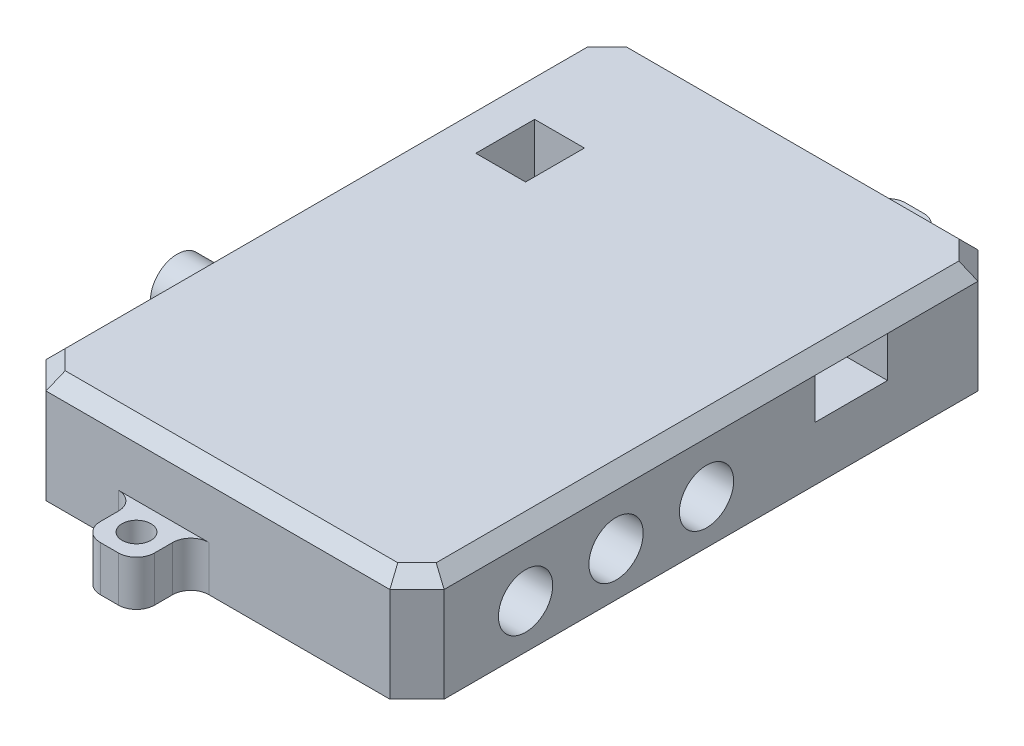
ISO-10303-21;
HEADER;
FILE_DESCRIPTION(('STEP AP214'),'2;1');
FILE_NAME('part.step','',(''),(''),'','','');
FILE_SCHEMA(('AUTOMOTIVE_DESIGN { 1 0 10303 214 1 1 1 1 }'));
ENDSEC;
DATA;
#1=APPLICATION_CONTEXT('core data for automotive mechanical design processes');
#2=APPLICATION_PROTOCOL_DEFINITION('international standard','automotive_design',2000,#1);
#3=PRODUCT_CONTEXT('',#1,'mechanical');
#4=PRODUCT('Part','Part','',(#3));
#5=PRODUCT_RELATED_PRODUCT_CATEGORY('part','',(#4));
#6=PRODUCT_DEFINITION_FORMATION('','',#4);
#7=PRODUCT_DEFINITION_CONTEXT('part definition',#1,'design');
#8=PRODUCT_DEFINITION('design','',#6,#7);
#9=PRODUCT_DEFINITION_SHAPE('','',#8);
#10=(LENGTH_UNIT() NAMED_UNIT(*) SI_UNIT(.MILLI.,.METRE.));
#11=(NAMED_UNIT(*) PLANE_ANGLE_UNIT() SI_UNIT($,.RADIAN.));
#12=(NAMED_UNIT(*) SI_UNIT($,.STERADIAN.) SOLID_ANGLE_UNIT());
#13=UNCERTAINTY_MEASURE_WITH_UNIT(LENGTH_MEASURE(1.E-05),#10,'distance_accuracy_value','');
#14=(GEOMETRIC_REPRESENTATION_CONTEXT(3) GLOBAL_UNCERTAINTY_ASSIGNED_CONTEXT((#13)) GLOBAL_UNIT_ASSIGNED_CONTEXT((#10,
#11,#12)) REPRESENTATION_CONTEXT('',''));
#15=CARTESIAN_POINT('',(0.,0.,0.));
#16=DIRECTION('',(0.,0.,1.));
#17=DIRECTION('',(1.,0.,0.));
#18=AXIS2_PLACEMENT_3D('',#15,#16,#17);
#19=CARTESIAN_POINT('',(-22.,12.,-32.5));
#20=DIRECTION('',(1.,0.,0.));
#21=DIRECTION('',(0.,0.,-1.));
#22=AXIS2_PLACEMENT_3D('',#19,#20,#21);
#23=PLANE('',#22);
#24=DIRECTION('',(0.,1.,0.));
#25=VECTOR('',#24,1.);
#26=CARTESIAN_POINT('',(-22.,12.,29.5));
#27=LINE('',#26,#25);
#28=CARTESIAN_POINT('',(-22.,0.,29.5));
#29=VERTEX_POINT('',#28);
#30=CARTESIAN_POINT('',(-22.,10.5,29.5));
#31=VERTEX_POINT('',#30);
#32=EDGE_CURVE('E436',#29,#31,#27,.T.);
#33=ORIENTED_EDGE('',*,*,#32,.T.);
#34=DIRECTION('',(0.,0.,-1.));
#35=VECTOR('',#34,1.);
#36=CARTESIAN_POINT('',(-22.,10.5,-29.5));
#37=LINE('',#36,#35);
#38=CARTESIAN_POINT('',(-22.,10.5,-29.5));
#39=VERTEX_POINT('',#38);
#40=EDGE_CURVE('E622',#31,#39,#37,.T.);
#41=ORIENTED_EDGE('',*,*,#40,.T.);
#42=DIRECTION('',(0.,-1.,0.));
#43=VECTOR('',#42,1.);
#44=CARTESIAN_POINT('',(-22.,12.,-29.5));
#45=LINE('',#44,#43);
#46=CARTESIAN_POINT('',(-22.,0.,-29.5));
#47=VERTEX_POINT('',#46);
#48=EDGE_CURVE('E560',#39,#47,#45,.T.);
#49=ORIENTED_EDGE('',*,*,#48,.T.);
#50=DIRECTION('',(0.,0.,1.));
#51=VECTOR('',#50,1.);
#52=CARTESIAN_POINT('',(-22.,0.,-32.5));
#53=LINE('',#52,#51);
#54=EDGE_CURVE('E406',#47,#29,#53,.T.);
#55=ORIENTED_EDGE('',*,*,#54,.T.);
#56=EDGE_LOOP('',(#33,#41,#49,#55));
#57=FACE_BOUND('',#56,.T.);
#58=CARTESIAN_POINT('',(-22.,5.38928565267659,10.));
#59=DIRECTION('',(1.,0.,0.));
#60=DIRECTION('',(0.,0.,-1.));
#61=AXIS2_PLACEMENT_3D('',#58,#59,#60);
#62=CIRCLE('',#61,2.96404503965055);
#63=CARTESIAN_POINT('',(-22.,5.38928565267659,7.03595496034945));
#64=VERTEX_POINT('',#63);
#65=EDGE_CURVE('E11',#64,#64,#62,.F.);
#66=ORIENTED_EDGE('',*,*,#65,.F.);
#67=EDGE_LOOP('',(#66));
#68=FACE_BOUND('',#67,.T.);
#69=ADVANCED_FACE('F32',(#57,#68),#23,.F.);
#70=CARTESIAN_POINT('',(-22.,12.,-32.5));
#71=DIRECTION('',(0.,0.,1.));
#72=DIRECTION('',(1.,0.,0.));
#73=AXIS2_PLACEMENT_3D('',#70,#71,#72);
#74=PLANE('',#73);
#75=DIRECTION('',(-1.,0.,0.));
#76=VECTOR('',#75,1.);
#77=CARTESIAN_POINT('',(-22.,0.,-32.5));
#78=LINE('',#77,#76);
#79=CARTESIAN_POINT('',(19.,0.,-32.5));
#80=VERTEX_POINT('',#79);
#81=CARTESIAN_POINT('',(11.,0.,-32.5));
#82=VERTEX_POINT('',#81);
#83=EDGE_CURVE('E413',#80,#82,#78,.T.);
#84=ORIENTED_EDGE('',*,*,#83,.T.);
#85=DIRECTION('',(0.,-1.,0.));
#86=VECTOR('',#85,1.);
#87=CARTESIAN_POINT('',(11.,12.,-32.5));
#88=LINE('',#87,#86);
#89=CARTESIAN_POINT('',(11.,5.,-32.5));
#90=VERTEX_POINT('',#89);
#91=EDGE_CURVE('E426',#82,#90,#88,.F.);
#92=ORIENTED_EDGE('',*,*,#91,.T.);
#93=DIRECTION('',(-1.,0.,0.));
#94=VECTOR('',#93,1.);
#95=CARTESIAN_POINT('',(3.,5.,-32.5));
#96=LINE('',#95,#94);
#97=CARTESIAN_POINT('',(0.999999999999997,5.,-32.5));
#98=VERTEX_POINT('',#97);
#99=EDGE_CURVE('E372',#90,#98,#96,.T.);
#100=ORIENTED_EDGE('',*,*,#99,.T.);
#101=DIRECTION('',(0.,-1.,0.));
#102=VECTOR('',#101,1.);
#103=CARTESIAN_POINT('',(0.999999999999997,12.,-32.5));
#104=LINE('',#103,#102);
#105=CARTESIAN_POINT('',(0.999999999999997,0.,-32.5));
#106=VERTEX_POINT('',#105);
#107=EDGE_CURVE('E671',#98,#106,#104,.T.);
#108=ORIENTED_EDGE('',*,*,#107,.T.);
#109=CARTESIAN_POINT('',(-19.,0.,-32.5));
#110=VERTEX_POINT('',#109);
#111=EDGE_CURVE('E402',#106,#110,#78,.T.);
#112=ORIENTED_EDGE('',*,*,#111,.T.);
#113=DIRECTION('',(0.,1.,0.));
#114=VECTOR('',#113,1.);
#115=CARTESIAN_POINT('',(-19.,12.,-32.5));
#116=LINE('',#115,#114);
#117=CARTESIAN_POINT('',(-19.,10.5,-32.5));
#118=VERTEX_POINT('',#117);
#119=EDGE_CURVE('E580',#110,#118,#116,.T.);
#120=ORIENTED_EDGE('',*,*,#119,.T.);
#121=DIRECTION('',(1.,0.,0.));
#122=VECTOR('',#121,1.);
#123=CARTESIAN_POINT('',(19.,10.5,-32.5));
#124=LINE('',#123,#122);
#125=CARTESIAN_POINT('',(19.,10.5,-32.5));
#126=VERTEX_POINT('',#125);
#127=EDGE_CURVE('E626',#118,#126,#124,.T.);
#128=ORIENTED_EDGE('',*,*,#127,.T.);
#129=DIRECTION('',(0.,-1.,0.));
#130=VECTOR('',#129,1.);
#131=CARTESIAN_POINT('',(19.,12.,-32.5));
#132=LINE('',#131,#130);
#133=EDGE_CURVE('E578',#126,#80,#132,.T.);
#134=ORIENTED_EDGE('',*,*,#133,.T.);
#135=EDGE_LOOP('',(#84,#92,#100,#108,#112,#120,#128,#134));
#136=FACE_BOUND('',#135,.T.);
#137=ADVANCED_FACE('F668',(#136),#74,.F.);
#138=CARTESIAN_POINT('',(-22.,12.,32.5));
#139=DIRECTION('',(0.,0.,-1.));
#140=DIRECTION('',(-1.,0.,0.));
#141=AXIS2_PLACEMENT_3D('',#138,#139,#140);
#142=PLANE('',#141);
#143=DIRECTION('',(1.,0.,0.));
#144=VECTOR('',#143,1.);
#145=CARTESIAN_POINT('',(-9.,5.,32.5));
#146=LINE('',#145,#144);
#147=CARTESIAN_POINT('',(-11.,5.,32.5));
#148=VERTEX_POINT('',#147);
#149=CARTESIAN_POINT('',(-1.,5.,32.5));
#150=VERTEX_POINT('',#149);
#151=EDGE_CURVE('E386',#148,#150,#146,.T.);
#152=ORIENTED_EDGE('',*,*,#151,.T.);
#153=DIRECTION('',(0.,-1.,0.));
#154=VECTOR('',#153,1.);
#155=CARTESIAN_POINT('',(-1.,12.,32.5));
#156=LINE('',#155,#154);
#157=CARTESIAN_POINT('',(-1.,0.,32.5));
#158=VERTEX_POINT('',#157);
#159=EDGE_CURVE('E447',#150,#158,#156,.T.);
#160=ORIENTED_EDGE('',*,*,#159,.T.);
#161=DIRECTION('',(1.,0.,0.));
#162=VECTOR('',#161,1.);
#163=CARTESIAN_POINT('',(-22.,0.,32.5));
#164=LINE('',#163,#162);
#165=CARTESIAN_POINT('',(19.,0.,32.5));
#166=VERTEX_POINT('',#165);
#167=EDGE_CURVE('E430',#158,#166,#164,.T.);
#168=ORIENTED_EDGE('',*,*,#167,.T.);
#169=DIRECTION('',(0.,1.,0.));
#170=VECTOR('',#169,1.);
#171=CARTESIAN_POINT('',(19.,12.,32.5));
#172=LINE('',#171,#170);
#173=CARTESIAN_POINT('',(19.,10.5,32.5));
#174=VERTEX_POINT('',#173);
#175=EDGE_CURVE('E590',#166,#174,#172,.T.);
#176=ORIENTED_EDGE('',*,*,#175,.T.);
#177=DIRECTION('',(-1.,0.,0.));
#178=VECTOR('',#177,1.);
#179=CARTESIAN_POINT('',(-19.,10.5,32.5));
#180=LINE('',#179,#178);
#181=CARTESIAN_POINT('',(-19.,10.5,32.5));
#182=VERTEX_POINT('',#181);
#183=EDGE_CURVE('E619',#174,#182,#180,.T.);
#184=ORIENTED_EDGE('',*,*,#183,.T.);
#185=DIRECTION('',(0.,-1.,0.));
#186=VECTOR('',#185,1.);
#187=CARTESIAN_POINT('',(-19.,12.,32.5));
#188=LINE('',#187,#186);
#189=CARTESIAN_POINT('',(-19.,0.,32.5));
#190=VERTEX_POINT('',#189);
#191=EDGE_CURVE('E588',#182,#190,#188,.T.);
#192=ORIENTED_EDGE('',*,*,#191,.T.);
#193=CARTESIAN_POINT('',(-11.,0.,32.5));
#194=VERTEX_POINT('',#193);
#195=EDGE_CURVE('E432',#190,#194,#164,.T.);
#196=ORIENTED_EDGE('',*,*,#195,.T.);
#197=DIRECTION('',(0.,-1.,0.));
#198=VECTOR('',#197,1.);
#199=CARTESIAN_POINT('',(-11.,12.,32.5));
#200=LINE('',#199,#198);
#201=EDGE_CURVE('E429',#194,#148,#200,.F.);
#202=ORIENTED_EDGE('',*,*,#201,.T.);
#203=EDGE_LOOP('',(#152,#160,#168,#176,#184,#192,#196,#202));
#204=FACE_BOUND('',#203,.T.);
#205=ADVANCED_FACE('F546',(#204),#142,.F.);
#206=CARTESIAN_POINT('',(22.,12.,-32.5));
#207=DIRECTION('',(-1.,0.,0.));
#208=DIRECTION('',(0.,0.,1.));
#209=AXIS2_PLACEMENT_3D('',#206,#207,#208);
#210=PLANE('',#209);
#211=CARTESIAN_POINT('',(22.,4.90071417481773,0.499999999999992));
#212=DIRECTION('',(1.,0.,0.));
#213=DIRECTION('',(0.,0.,-1.));
#214=AXIS2_PLACEMENT_3D('',#211,#212,#213);
#215=CIRCLE('',#214,3.);
#216=CARTESIAN_POINT('',(22.,4.90071417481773,-2.50000000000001));
#217=VERTEX_POINT('',#216);
#218=EDGE_CURVE('E338',#217,#217,#215,.T.);
#219=ORIENTED_EDGE('',*,*,#218,.F.);
#220=EDGE_LOOP('',(#219));
#221=FACE_BOUND('',#220,.T.);
#222=CARTESIAN_POINT('',(22.,4.90071417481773,10.5));
#223=DIRECTION('',(1.,0.,0.));
#224=DIRECTION('',(0.,0.,-1.));
#225=AXIS2_PLACEMENT_3D('',#222,#223,#224);
#226=CIRCLE('',#225,3.);
#227=CARTESIAN_POINT('',(22.,4.90071417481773,7.49999999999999));
#228=VERTEX_POINT('',#227);
#229=EDGE_CURVE('E342',#228,#228,#226,.T.);
#230=ORIENTED_EDGE('',*,*,#229,.F.);
#231=EDGE_LOOP('',(#230));
#232=FACE_BOUND('',#231,.T.);
#233=CARTESIAN_POINT('',(22.,4.90071417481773,20.5));
#234=DIRECTION('',(1.,0.,0.));
#235=DIRECTION('',(0.,0.,-1.));
#236=AXIS2_PLACEMENT_3D('',#233,#234,#235);
#237=CIRCLE('',#236,3.);
#238=CARTESIAN_POINT('',(22.,4.90071417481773,17.5));
#239=VERTEX_POINT('',#238);
#240=EDGE_CURVE('E348',#239,#239,#237,.T.);
#241=ORIENTED_EDGE('',*,*,#240,.F.);
#242=EDGE_LOOP('',(#241));
#243=FACE_BOUND('',#242,.T.);
#244=DIRECTION('',(0.,0.,-1.));
#245=VECTOR('',#244,1.);
#246=CARTESIAN_POINT('',(22.,6.,-11.5));
#247=LINE('',#246,#245);
#248=CARTESIAN_POINT('',(22.,6.,-11.5));
#249=VERTEX_POINT('',#248);
#250=CARTESIAN_POINT('',(22.,6.,-19.5));
#251=VERTEX_POINT('',#250);
#252=EDGE_CURVE('E297',#249,#251,#247,.T.);
#253=ORIENTED_EDGE('',*,*,#252,.F.);
#254=DIRECTION('',(0.,-1.,0.));
#255=VECTOR('',#254,1.);
#256=CARTESIAN_POINT('',(22.,10.5,-11.5));
#257=LINE('',#256,#255);
#258=CARTESIAN_POINT('',(22.,10.5,-11.5));
#259=VERTEX_POINT('',#258);
#260=EDGE_CURVE('E272',#259,#249,#257,.T.);
#261=ORIENTED_EDGE('',*,*,#260,.F.);
#262=DIRECTION('',(0.,0.,1.));
#263=VECTOR('',#262,1.);
#264=CARTESIAN_POINT('',(22.,10.5,29.5));
#265=LINE('',#264,#263);
#266=CARTESIAN_POINT('',(22.,10.5,29.5));
#267=VERTEX_POINT('',#266);
#268=EDGE_CURVE('E613',#259,#267,#265,.T.);
#269=ORIENTED_EDGE('',*,*,#268,.T.);
#270=DIRECTION('',(0.,-1.,0.));
#271=VECTOR('',#270,1.);
#272=CARTESIAN_POINT('',(22.,12.,29.5));
#273=LINE('',#272,#271);
#274=CARTESIAN_POINT('',(22.,0.,29.5));
#275=VERTEX_POINT('',#274);
#276=EDGE_CURVE('E583',#267,#275,#273,.T.);
#277=ORIENTED_EDGE('',*,*,#276,.T.);
#278=DIRECTION('',(0.,0.,-1.));
#279=VECTOR('',#278,1.);
#280=CARTESIAN_POINT('',(22.,0.,-32.5));
#281=LINE('',#280,#279);
#282=CARTESIAN_POINT('',(22.,0.,-29.5));
#283=VERTEX_POINT('',#282);
#284=EDGE_CURVE('E399',#275,#283,#281,.T.);
#285=ORIENTED_EDGE('',*,*,#284,.T.);
#286=DIRECTION('',(0.,1.,0.));
#287=VECTOR('',#286,1.);
#288=CARTESIAN_POINT('',(22.,12.,-29.5));
#289=LINE('',#288,#287);
#290=CARTESIAN_POINT('',(22.,10.5,-29.5));
#291=VERTEX_POINT('',#290);
#292=EDGE_CURVE('E585',#283,#291,#289,.T.);
#293=ORIENTED_EDGE('',*,*,#292,.T.);
#294=CARTESIAN_POINT('',(22.,10.5,-19.5));
#295=VERTEX_POINT('',#294);
#296=EDGE_CURVE('E614',#291,#295,#265,.T.);
#297=ORIENTED_EDGE('',*,*,#296,.T.);
#298=DIRECTION('',(0.,1.,0.));
#299=VECTOR('',#298,1.);
#300=CARTESIAN_POINT('',(22.,10.5,-19.5));
#301=LINE('',#300,#299);
#302=EDGE_CURVE('E47',#251,#295,#301,.T.);
#303=ORIENTED_EDGE('',*,*,#302,.F.);
#304=EDGE_LOOP('',(#253,#261,#269,#277,#285,#293,#297,#303));
#305=FACE_BOUND('',#304,.T.);
#306=ADVANCED_FACE('F697',(#221,#232,#243,#305),#210,.F.);
#307=CARTESIAN_POINT('',(0.,12.,0.));
#308=DIRECTION('',(0.,1.,0.));
#309=DIRECTION('',(0.,0.,1.));
#310=AXIS2_PLACEMENT_3D('',#307,#308,#309);
#311=PLANE('',#310);
#312=DIRECTION('',(0.,0.,-1.));
#313=VECTOR('',#312,1.);
#314=CARTESIAN_POINT('',(-16.5,12.,-19.));
#315=LINE('',#314,#313);
#316=CARTESIAN_POINT('',(-16.5,12.,-12.5));
#317=VERTEX_POINT('',#316);
#318=CARTESIAN_POINT('',(-16.5,12.,-19.));
#319=VERTEX_POINT('',#318);
#320=EDGE_CURVE('E306',#317,#319,#315,.T.);
#321=ORIENTED_EDGE('',*,*,#320,.T.);
#322=DIRECTION('',(1.,0.,0.));
#323=VECTOR('',#322,1.);
#324=CARTESIAN_POINT('',(-16.5,12.,-19.));
#325=LINE('',#324,#323);
#326=CARTESIAN_POINT('',(-11.,12.,-19.));
#327=VERTEX_POINT('',#326);
#328=EDGE_CURVE('E309',#319,#327,#325,.T.);
#329=ORIENTED_EDGE('',*,*,#328,.T.);
#330=DIRECTION('',(0.,0.,1.));
#331=VECTOR('',#330,1.);
#332=CARTESIAN_POINT('',(-11.,12.,-19.));
#333=LINE('',#332,#331);
#334=CARTESIAN_POINT('',(-11.,12.,-12.5));
#335=VERTEX_POINT('',#334);
#336=EDGE_CURVE('E55',#327,#335,#333,.T.);
#337=ORIENTED_EDGE('',*,*,#336,.T.);
#338=DIRECTION('',(-1.,0.,0.));
#339=VECTOR('',#338,1.);
#340=CARTESIAN_POINT('',(-16.5,12.,-12.5));
#341=LINE('',#340,#339);
#342=EDGE_CURVE('E314',#335,#317,#341,.T.);
#343=ORIENTED_EDGE('',*,*,#342,.T.);
#344=EDGE_LOOP('',(#321,#329,#337,#343));
#345=FACE_BOUND('',#344,.T.);
#346=DIRECTION('',(0.,0.,-1.));
#347=VECTOR('',#346,1.);
#348=CARTESIAN_POINT('',(20.5,12.,-29.5));
#349=LINE('',#348,#347);
#350=CARTESIAN_POINT('',(20.5,12.,28.8786796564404));
#351=VERTEX_POINT('',#350);
#352=CARTESIAN_POINT('',(20.5,12.,-28.8786796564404));
#353=VERTEX_POINT('',#352);
#354=EDGE_CURVE('E605',#351,#353,#349,.T.);
#355=ORIENTED_EDGE('',*,*,#354,.T.);
#356=DIRECTION('',(-0.707106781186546,0.,-0.707106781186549));
#357=VECTOR('',#356,1.);
#358=CARTESIAN_POINT('',(24.6893398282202,12.,-24.6893398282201));
#359=LINE('',#358,#357);
#360=CARTESIAN_POINT('',(18.3786796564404,12.,-31.));
#361=VERTEX_POINT('',#360);
#362=EDGE_CURVE('E607',#353,#361,#359,.T.);
#363=ORIENTED_EDGE('',*,*,#362,.T.);
#364=DIRECTION('',(-1.,0.,0.));
#365=VECTOR('',#364,1.);
#366=CARTESIAN_POINT('',(-19.,12.,-31.));
#367=LINE('',#366,#365);
#368=CARTESIAN_POINT('',(-18.3786796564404,12.,-31.));
#369=VERTEX_POINT('',#368);
#370=EDGE_CURVE('E593',#361,#369,#367,.T.);
#371=ORIENTED_EDGE('',*,*,#370,.T.);
#372=DIRECTION('',(-0.70710678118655,0.,0.707106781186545));
#373=VECTOR('',#372,1.);
#374=CARTESIAN_POINT('',(-24.6893398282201,12.,-24.6893398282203));
#375=LINE('',#374,#373);
#376=CARTESIAN_POINT('',(-20.5,12.,-28.8786796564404));
#377=VERTEX_POINT('',#376);
#378=EDGE_CURVE('E595',#369,#377,#375,.T.);
#379=ORIENTED_EDGE('',*,*,#378,.T.);
#380=DIRECTION('',(0.,0.,1.));
#381=VECTOR('',#380,1.);
#382=CARTESIAN_POINT('',(-20.5,12.,29.5));
#383=LINE('',#382,#381);
#384=CARTESIAN_POINT('',(-20.5,12.,28.8786796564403));
#385=VERTEX_POINT('',#384);
#386=EDGE_CURVE('E597',#377,#385,#383,.T.);
#387=ORIENTED_EDGE('',*,*,#386,.T.);
#388=DIRECTION('',(0.707106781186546,0.,0.707106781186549));
#389=VECTOR('',#388,1.);
#390=CARTESIAN_POINT('',(-24.6893398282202,12.,24.6893398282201));
#391=LINE('',#390,#389);
#392=CARTESIAN_POINT('',(-18.3786796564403,12.,31.));
#393=VERTEX_POINT('',#392);
#394=EDGE_CURVE('E599',#385,#393,#391,.T.);
#395=ORIENTED_EDGE('',*,*,#394,.T.);
#396=DIRECTION('',(1.,0.,0.));
#397=VECTOR('',#396,1.);
#398=CARTESIAN_POINT('',(19.,12.,31.));
#399=LINE('',#398,#397);
#400=CARTESIAN_POINT('',(18.3786796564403,12.,31.));
#401=VERTEX_POINT('',#400);
#402=EDGE_CURVE('E601',#393,#401,#399,.T.);
#403=ORIENTED_EDGE('',*,*,#402,.T.);
#404=DIRECTION('',(0.707106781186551,0.,-0.707106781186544));
#405=VECTOR('',#404,1.);
#406=CARTESIAN_POINT('',(24.6893398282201,12.,24.6893398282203));
#407=LINE('',#406,#405);
#408=EDGE_CURVE('E603',#401,#351,#407,.T.);
#409=ORIENTED_EDGE('',*,*,#408,.T.);
#410=EDGE_LOOP('',(#355,#363,#371,#379,#387,#395,#403,#409));
#411=FACE_BOUND('',#410,.T.);
#412=ADVANCED_FACE('F717',(#345,#411),#311,.T.);
#413=CARTESIAN_POINT('',(0.,0.,0.));
#414=DIRECTION('',(0.,1.,0.));
#415=DIRECTION('',(0.,0.,1.));
#416=AXIS2_PLACEMENT_3D('',#413,#414,#415);
#417=PLANE('',#416);
#418=DIRECTION('',(1.,0.,0.));
#419=VECTOR('',#418,1.);
#420=CARTESIAN_POINT('',(-16.5,0.,-19.));
#421=LINE('',#420,#419);
#422=CARTESIAN_POINT('',(-16.5,0.,-19.));
#423=VERTEX_POINT('',#422);
#424=CARTESIAN_POINT('',(-11.,0.,-19.));
#425=VERTEX_POINT('',#424);
#426=EDGE_CURVE('E319',#423,#425,#421,.T.);
#427=ORIENTED_EDGE('',*,*,#426,.F.);
#428=DIRECTION('',(0.,0.,-1.));
#429=VECTOR('',#428,1.);
#430=CARTESIAN_POINT('',(-16.5,0.,-19.));
#431=LINE('',#430,#429);
#432=CARTESIAN_POINT('',(-16.5,0.,-12.5));
#433=VERTEX_POINT('',#432);
#434=EDGE_CURVE('E302',#433,#423,#431,.T.);
#435=ORIENTED_EDGE('',*,*,#434,.F.);
#436=DIRECTION('',(-1.,0.,0.));
#437=VECTOR('',#436,1.);
#438=CARTESIAN_POINT('',(-16.5,0.,-12.5));
#439=LINE('',#438,#437);
#440=CARTESIAN_POINT('',(-11.,0.,-12.5));
#441=VERTEX_POINT('',#440);
#442=EDGE_CURVE('E310',#441,#433,#439,.T.);
#443=ORIENTED_EDGE('',*,*,#442,.F.);
#444=DIRECTION('',(0.,0.,1.));
#445=VECTOR('',#444,1.);
#446=CARTESIAN_POINT('',(-11.,0.,-19.));
#447=LINE('',#446,#445);
#448=EDGE_CURVE('E322',#425,#441,#447,.T.);
#449=ORIENTED_EDGE('',*,*,#448,.F.);
#450=EDGE_LOOP('',(#427,#435,#443,#449));
#451=FACE_BOUND('',#450,.T.);
#452=DIRECTION('',(1.,0.,0.));
#453=VECTOR('',#452,1.);
#454=CARTESIAN_POINT('',(3.,0.,-38.5));
#455=LINE('',#454,#453);
#456=CARTESIAN_POINT('',(5.,0.,-38.5));
#457=VERTEX_POINT('',#456);
#458=CARTESIAN_POINT('',(7.,0.,-38.5));
#459=VERTEX_POINT('',#458);
#460=EDGE_CURVE('E375',#457,#459,#455,.T.);
#461=ORIENTED_EDGE('',*,*,#460,.T.);
#462=CARTESIAN_POINT('',(7.,0.,-36.5));
#463=DIRECTION('',(0.,1.,0.));
#464=DIRECTION('',(0.,0.,1.));
#465=AXIS2_PLACEMENT_3D('',#462,#463,#464);
#466=CIRCLE('',#465,2.);
#467=CARTESIAN_POINT('',(9.,0.,-36.5));
#468=VERTEX_POINT('',#467);
#469=EDGE_CURVE('E486',#459,#468,#466,.F.);
#470=ORIENTED_EDGE('',*,*,#469,.T.);
#471=DIRECTION('',(0.,0.,1.));
#472=VECTOR('',#471,1.);
#473=CARTESIAN_POINT('',(9.,0.,-32.5));
#474=LINE('',#473,#472);
#475=CARTESIAN_POINT('',(9.,0.,-34.5));
#476=VERTEX_POINT('',#475);
#477=EDGE_CURVE('E367',#468,#476,#474,.T.);
#478=ORIENTED_EDGE('',*,*,#477,.T.);
#479=CARTESIAN_POINT('',(11.,0.,-34.5));
#480=DIRECTION('',(0.,1.,0.));
#481=DIRECTION('',(0.,0.,1.));
#482=AXIS2_PLACEMENT_3D('',#479,#480,#481);
#483=CIRCLE('',#482,2.);
#484=EDGE_CURVE('E453',#476,#82,#483,.T.);
#485=ORIENTED_EDGE('',*,*,#484,.T.);
#486=ORIENTED_EDGE('',*,*,#83,.F.);
#487=DIRECTION('',(-0.707106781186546,0.,-0.707106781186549));
#488=VECTOR('',#487,1.);
#489=CARTESIAN_POINT('',(19.,0.,-32.5));
#490=LINE('',#489,#488);
#491=EDGE_CURVE('E574',#80,#283,#490,.F.);
#492=ORIENTED_EDGE('',*,*,#491,.T.);
#493=ORIENTED_EDGE('',*,*,#284,.F.);
#494=DIRECTION('',(0.707106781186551,0.,-0.707106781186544));
#495=VECTOR('',#494,1.);
#496=CARTESIAN_POINT('',(22.,0.,29.5));
#497=LINE('',#496,#495);
#498=EDGE_CURVE('E559',#275,#166,#497,.F.);
#499=ORIENTED_EDGE('',*,*,#498,.T.);
#500=ORIENTED_EDGE('',*,*,#167,.F.);
#501=CARTESIAN_POINT('',(-1.,0.,34.5));
#502=DIRECTION('',(0.,1.,0.));
#503=DIRECTION('',(0.,0.,1.));
#504=AXIS2_PLACEMENT_3D('',#501,#502,#503);
#505=CIRCLE('',#504,2.);
#506=CARTESIAN_POINT('',(-3.,0.,34.5));
#507=VERTEX_POINT('',#506);
#508=EDGE_CURVE('E463',#158,#507,#505,.T.);
#509=ORIENTED_EDGE('',*,*,#508,.T.);
#510=DIRECTION('',(0.,0.,1.));
#511=VECTOR('',#510,1.);
#512=CARTESIAN_POINT('',(-3.,0.,32.5));
#513=LINE('',#512,#511);
#514=CARTESIAN_POINT('',(-3.,0.,36.5));
#515=VERTEX_POINT('',#514);
#516=EDGE_CURVE('E398',#507,#515,#513,.T.);
#517=ORIENTED_EDGE('',*,*,#516,.T.);
#518=CARTESIAN_POINT('',(-5.,0.,36.5));
#519=DIRECTION('',(0.,1.,0.));
#520=DIRECTION('',(0.,0.,1.));
#521=AXIS2_PLACEMENT_3D('',#518,#519,#520);
#522=CIRCLE('',#521,2.);
#523=CARTESIAN_POINT('',(-5.,0.,38.5));
#524=VERTEX_POINT('',#523);
#525=EDGE_CURVE('E482',#515,#524,#522,.F.);
#526=ORIENTED_EDGE('',*,*,#525,.T.);
#527=DIRECTION('',(-1.,0.,0.));
#528=VECTOR('',#527,1.);
#529=CARTESIAN_POINT('',(-9.,0.,38.5));
#530=LINE('',#529,#528);
#531=CARTESIAN_POINT('',(-7.,0.,38.5));
#532=VERTEX_POINT('',#531);
#533=EDGE_CURVE('E387',#524,#532,#530,.T.);
#534=ORIENTED_EDGE('',*,*,#533,.T.);
#535=CARTESIAN_POINT('',(-7.,0.,36.5));
#536=DIRECTION('',(0.,1.,0.));
#537=DIRECTION('',(0.,0.,1.));
#538=AXIS2_PLACEMENT_3D('',#535,#536,#537);
#539=CIRCLE('',#538,2.);
#540=CARTESIAN_POINT('',(-9.,0.,36.5));
#541=VERTEX_POINT('',#540);
#542=EDGE_CURVE('E478',#532,#541,#539,.F.);
#543=ORIENTED_EDGE('',*,*,#542,.T.);
#544=DIRECTION('',(0.,0.,-1.));
#545=VECTOR('',#544,1.);
#546=CARTESIAN_POINT('',(-9.,0.,32.5));
#547=LINE('',#546,#545);
#548=CARTESIAN_POINT('',(-9.,0.,34.5));
#549=VERTEX_POINT('',#548);
#550=EDGE_CURVE('E381',#541,#549,#547,.T.);
#551=ORIENTED_EDGE('',*,*,#550,.T.);
#552=CARTESIAN_POINT('',(-11.,0.,34.5));
#553=DIRECTION('',(0.,1.,0.));
#554=DIRECTION('',(0.,0.,1.));
#555=AXIS2_PLACEMENT_3D('',#552,#553,#554);
#556=CIRCLE('',#555,2.);
#557=EDGE_CURVE('E468',#549,#194,#556,.T.);
#558=ORIENTED_EDGE('',*,*,#557,.T.);
#559=ORIENTED_EDGE('',*,*,#195,.F.);
#560=DIRECTION('',(0.707106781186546,0.,0.707106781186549));
#561=VECTOR('',#560,1.);
#562=CARTESIAN_POINT('',(-19.,0.,32.5));
#563=LINE('',#562,#561);
#564=EDGE_CURVE('E553',#190,#29,#563,.F.);
#565=ORIENTED_EDGE('',*,*,#564,.T.);
#566=ORIENTED_EDGE('',*,*,#54,.F.);
#567=DIRECTION('',(-0.70710678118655,0.,0.707106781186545));
#568=VECTOR('',#567,1.);
#569=CARTESIAN_POINT('',(-22.,0.,-29.5));
#570=LINE('',#569,#568);
#571=EDGE_CURVE('E576',#47,#110,#570,.F.);
#572=ORIENTED_EDGE('',*,*,#571,.T.);
#573=ORIENTED_EDGE('',*,*,#111,.F.);
#574=CARTESIAN_POINT('',(0.999999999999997,0.,-34.5));
#575=DIRECTION('',(0.,1.,0.));
#576=DIRECTION('',(0.,0.,1.));
#577=AXIS2_PLACEMENT_3D('',#574,#575,#576);
#578=CIRCLE('',#577,2.);
#579=CARTESIAN_POINT('',(3.,0.,-34.5));
#580=VERTEX_POINT('',#579);
#581=EDGE_CURVE('E458',#106,#580,#578,.T.);
#582=ORIENTED_EDGE('',*,*,#581,.T.);
#583=DIRECTION('',(0.,0.,-1.));
#584=VECTOR('',#583,1.);
#585=CARTESIAN_POINT('',(3.,0.,-32.5));
#586=LINE('',#585,#584);
#587=CARTESIAN_POINT('',(3.,0.,-36.5));
#588=VERTEX_POINT('',#587);
#589=EDGE_CURVE('E360',#580,#588,#586,.T.);
#590=ORIENTED_EDGE('',*,*,#589,.T.);
#591=CARTESIAN_POINT('',(5.,0.,-36.5));
#592=DIRECTION('',(0.,1.,0.));
#593=DIRECTION('',(0.,0.,1.));
#594=AXIS2_PLACEMENT_3D('',#591,#592,#593);
#595=CIRCLE('',#594,2.);
#596=EDGE_CURVE('E484',#588,#457,#595,.F.);
#597=ORIENTED_EDGE('',*,*,#596,.T.);
#598=EDGE_LOOP('',(#461,#470,#478,#485,#486,#492,#493,#499,#500,#509,#517,#526,#534,#543,#551,
#558,#559,#565,#566,#572,#573,#582,#590,#597));
#599=FACE_BOUND('',#598,.T.);
#600=CARTESIAN_POINT('',(-6.,0.,35.5));
#601=DIRECTION('',(0.,-1.,0.));
#602=DIRECTION('',(0.,0.,-1.));
#603=AXIS2_PLACEMENT_3D('',#600,#601,#602);
#604=CIRCLE('',#603,1.6);
#605=CARTESIAN_POINT('',(-6.,0.,33.9));
#606=VERTEX_POINT('',#605);
#607=EDGE_CURVE('E374',#606,#606,#604,.T.);
#608=ORIENTED_EDGE('',*,*,#607,.F.);
#609=EDGE_LOOP('',(#608));
#610=FACE_BOUND('',#609,.T.);
#611=CARTESIAN_POINT('',(6.,0.,-35.5));
#612=DIRECTION('',(0.,-1.,0.));
#613=DIRECTION('',(0.,0.,-1.));
#614=AXIS2_PLACEMENT_3D('',#611,#612,#613);
#615=CIRCLE('',#614,1.6);
#616=CARTESIAN_POINT('',(6.,0.,-37.1));
#617=VERTEX_POINT('',#616);
#618=EDGE_CURVE('E354',#617,#617,#615,.T.);
#619=ORIENTED_EDGE('',*,*,#618,.F.);
#620=EDGE_LOOP('',(#619));
#621=FACE_BOUND('',#620,.T.);
#622=ADVANCED_FACE('F526',(#451,#599,#610,#621),#417,.F.);
#623=CARTESIAN_POINT('',(-22.,12.,-29.5));
#624=DIRECTION('',(0.707106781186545,0.,0.70710678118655));
#625=DIRECTION('',(0.,-1.,0.));
#626=AXIS2_PLACEMENT_3D('',#623,#624,#625);
#627=PLANE('',#626);
#628=ORIENTED_EDGE('',*,*,#48,.F.);
#629=DIRECTION('',(-0.70710678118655,0.,0.707106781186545));
#630=VECTOR('',#629,1.);
#631=CARTESIAN_POINT('',(-22.,10.5,-29.5));
#632=LINE('',#631,#630);
#633=EDGE_CURVE('E624',#39,#118,#632,.F.);
#634=ORIENTED_EDGE('',*,*,#633,.T.);
#635=ORIENTED_EDGE('',*,*,#119,.F.);
#636=ORIENTED_EDGE('',*,*,#571,.F.);
#637=EDGE_LOOP('',(#628,#634,#635,#636));
#638=FACE_BOUND('',#637,.T.);
#639=ADVANCED_FACE('F662',(#638),#627,.F.);
#640=CARTESIAN_POINT('',(19.,12.,-32.5));
#641=DIRECTION('',(-0.707106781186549,0.,0.707106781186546));
#642=DIRECTION('',(0.,-1.,0.));
#643=AXIS2_PLACEMENT_3D('',#640,#641,#642);
#644=PLANE('',#643);
#645=ORIENTED_EDGE('',*,*,#133,.F.);
#646=DIRECTION('',(-0.707106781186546,0.,-0.707106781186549));
#647=VECTOR('',#646,1.);
#648=CARTESIAN_POINT('',(19.,10.5,-32.5));
#649=LINE('',#648,#647);
#650=EDGE_CURVE('E610',#126,#291,#649,.F.);
#651=ORIENTED_EDGE('',*,*,#650,.T.);
#652=ORIENTED_EDGE('',*,*,#292,.F.);
#653=ORIENTED_EDGE('',*,*,#491,.F.);
#654=EDGE_LOOP('',(#645,#651,#652,#653));
#655=FACE_BOUND('',#654,.T.);
#656=ADVANCED_FACE('F694',(#655),#644,.F.);
#657=CARTESIAN_POINT('',(22.,12.,29.5));
#658=DIRECTION('',(-0.707106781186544,0.,-0.707106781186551));
#659=DIRECTION('',(0.,-1.,0.));
#660=AXIS2_PLACEMENT_3D('',#657,#658,#659);
#661=PLANE('',#660);
#662=ORIENTED_EDGE('',*,*,#276,.F.);
#663=DIRECTION('',(0.707106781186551,0.,-0.707106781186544));
#664=VECTOR('',#663,1.);
#665=CARTESIAN_POINT('',(22.,10.5,29.5));
#666=LINE('',#665,#664);
#667=EDGE_CURVE('E617',#267,#174,#666,.F.);
#668=ORIENTED_EDGE('',*,*,#667,.T.);
#669=ORIENTED_EDGE('',*,*,#175,.F.);
#670=ORIENTED_EDGE('',*,*,#498,.F.);
#671=EDGE_LOOP('',(#662,#668,#669,#670));
#672=FACE_BOUND('',#671,.T.);
#673=ADVANCED_FACE('F704',(#672),#661,.F.);
#674=CARTESIAN_POINT('',(-19.,12.,32.5));
#675=DIRECTION('',(0.707106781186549,0.,-0.707106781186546));
#676=DIRECTION('',(0.,-1.,0.));
#677=AXIS2_PLACEMENT_3D('',#674,#675,#676);
#678=PLANE('',#677);
#679=ORIENTED_EDGE('',*,*,#191,.F.);
#680=DIRECTION('',(0.707106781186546,0.,0.707106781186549));
#681=VECTOR('',#680,1.);
#682=CARTESIAN_POINT('',(-19.,10.5,32.5));
#683=LINE('',#682,#681);
#684=EDGE_CURVE('E570',#182,#31,#683,.F.);
#685=ORIENTED_EDGE('',*,*,#684,.T.);
#686=ORIENTED_EDGE('',*,*,#32,.F.);
#687=ORIENTED_EDGE('',*,*,#564,.F.);
#688=EDGE_LOOP('',(#679,#685,#686,#687));
#689=FACE_BOUND('',#688,.T.);
#690=ADVANCED_FACE('F568',(#689),#678,.F.);
#691=CARTESIAN_POINT('',(-24.6893398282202,12.,24.6893398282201));
#692=DIRECTION('',(-0.500000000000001,0.707106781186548,0.499999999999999));
#693=DIRECTION('',(-0.707106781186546,0.,-0.707106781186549));
#694=AXIS2_PLACEMENT_3D('',#691,#692,#693);
#695=PLANE('',#694);
#696=DIRECTION('',(0.678598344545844,0.678598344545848,-0.281084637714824));
#697=VECTOR('',#696,1.);
#698=CARTESIAN_POINT('',(-14.9915775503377,17.5084224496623,26.5970163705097));
#699=LINE('',#698,#697);
#700=EDGE_CURVE('E643',#31,#385,#699,.T.);
#701=ORIENTED_EDGE('',*,*,#700,.F.);
#702=ORIENTED_EDGE('',*,*,#684,.F.);
#703=DIRECTION('',(0.281084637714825,0.678598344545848,-0.678598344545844));
#704=VECTOR('',#703,1.);
#705=CARTESIAN_POINT('',(-17.6735580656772,13.7023141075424,29.2976858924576));
#706=LINE('',#705,#704);
#707=EDGE_CURVE('E403',#393,#182,#706,.F.);
#708=ORIENTED_EDGE('',*,*,#707,.F.);
#709=ORIENTED_EDGE('',*,*,#394,.F.);
#710=EDGE_LOOP('',(#701,#702,#708,#709));
#711=FACE_BOUND('',#710,.T.);
#712=ADVANCED_FACE('F657',(#711),#695,.T.);
#713=CARTESIAN_POINT('',(0.,12.,31.));
#714=DIRECTION('',(0.,0.707106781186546,0.707106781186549));
#715=DIRECTION('',(-1.,0.,0.));
#716=AXIS2_PLACEMENT_3D('',#713,#714,#715);
#717=PLANE('',#716);
#718=ORIENTED_EDGE('',*,*,#707,.T.);
#719=ORIENTED_EDGE('',*,*,#183,.F.);
#720=DIRECTION('',(-0.281084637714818,0.678598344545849,-0.678598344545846));
#721=VECTOR('',#720,1.);
#722=CARTESIAN_POINT('',(16.9266063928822,15.5056149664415,27.4943850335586));
#723=LINE('',#722,#721);
#724=EDGE_CURVE('E641',#401,#174,#723,.F.);
#725=ORIENTED_EDGE('',*,*,#724,.F.);
#726=ORIENTED_EDGE('',*,*,#402,.F.);
#727=EDGE_LOOP('',(#718,#719,#725,#726));
#728=FACE_BOUND('',#727,.T.);
#729=ADVANCED_FACE('F653',(#728),#717,.T.);
#730=CARTESIAN_POINT('',(-20.5,12.,0.));
#731=DIRECTION('',(-0.70710678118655,0.707106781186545,0.));
#732=DIRECTION('',(0.,0.,-1.));
#733=AXIS2_PLACEMENT_3D('',#730,#731,#732);
#734=PLANE('',#733);
#735=ORIENTED_EDGE('',*,*,#700,.T.);
#736=ORIENTED_EDGE('',*,*,#386,.F.);
#737=DIRECTION('',(0.678598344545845,0.678598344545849,0.281084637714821));
#738=VECTOR('',#737,1.);
#739=CARTESIAN_POINT('',(-21.6300833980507,10.8699166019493,-29.3467755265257));
#740=LINE('',#739,#738);
#741=EDGE_CURVE('E638',#39,#377,#740,.T.);
#742=ORIENTED_EDGE('',*,*,#741,.F.);
#743=ORIENTED_EDGE('',*,*,#40,.F.);
#744=EDGE_LOOP('',(#735,#736,#742,#743));
#745=FACE_BOUND('',#744,.T.);
#746=ADVANCED_FACE('F659',(#745),#734,.T.);
#747=CARTESIAN_POINT('',(24.6893398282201,12.,24.6893398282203));
#748=DIRECTION('',(0.499999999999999,0.707106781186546,0.500000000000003));
#749=DIRECTION('',(-0.707106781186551,0.,0.707106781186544));
#750=AXIS2_PLACEMENT_3D('',#747,#748,#749);
#751=PLANE('',#750);
#752=ORIENTED_EDGE('',*,*,#724,.T.);
#753=ORIENTED_EDGE('',*,*,#667,.F.);
#754=DIRECTION('',(-0.678598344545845,0.678598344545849,-0.281084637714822));
#755=VECTOR('',#754,1.);
#756=CARTESIAN_POINT('',(21.6300833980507,10.8699166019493,29.3467755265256));
#757=LINE('',#756,#755);
#758=EDGE_CURVE('E635',#351,#267,#757,.F.);
#759=ORIENTED_EDGE('',*,*,#758,.F.);
#760=ORIENTED_EDGE('',*,*,#408,.F.);
#761=EDGE_LOOP('',(#752,#753,#759,#760));
#762=FACE_BOUND('',#761,.T.);
#763=ADVANCED_FACE('F707',(#762),#751,.T.);
#764=CARTESIAN_POINT('',(-24.6893398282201,12.,-24.6893398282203));
#765=DIRECTION('',(-0.5,0.707106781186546,-0.500000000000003));
#766=DIRECTION('',(0.70710678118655,0.,-0.707106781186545));
#767=AXIS2_PLACEMENT_3D('',#764,#765,#766);
#768=PLANE('',#767);
#769=ORIENTED_EDGE('',*,*,#741,.T.);
#770=ORIENTED_EDGE('',*,*,#378,.F.);
#771=DIRECTION('',(0.281084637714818,0.678598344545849,0.678598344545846));
#772=VECTOR('',#771,1.);
#773=CARTESIAN_POINT('',(-16.9266063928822,15.5056149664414,-27.4943850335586));
#774=LINE('',#773,#772);
#775=EDGE_CURVE('E632',#118,#369,#774,.T.);
#776=ORIENTED_EDGE('',*,*,#775,.F.);
#777=ORIENTED_EDGE('',*,*,#633,.F.);
#778=EDGE_LOOP('',(#769,#770,#776,#777));
#779=FACE_BOUND('',#778,.T.);
#780=ADVANCED_FACE('F720',(#779),#768,.T.);
#781=CARTESIAN_POINT('',(20.5,12.,0.));
#782=DIRECTION('',(0.70710678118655,0.707106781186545,0.));
#783=DIRECTION('',(0.,0.,1.));
#784=AXIS2_PLACEMENT_3D('',#781,#782,#783);
#785=PLANE('',#784);
#786=ORIENTED_EDGE('',*,*,#758,.T.);
#787=ORIENTED_EDGE('',*,*,#268,.F.);
#788=DIRECTION('',(0.,0.,1.));
#789=VECTOR('',#788,1.);
#790=CARTESIAN_POINT('',(22.,10.5,-11.5));
#791=LINE('',#790,#789);
#792=EDGE_CURVE('E289',#295,#259,#791,.T.);
#793=ORIENTED_EDGE('',*,*,#792,.F.);
#794=ORIENTED_EDGE('',*,*,#296,.F.);
#795=DIRECTION('',(-0.678598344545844,0.678598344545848,0.281084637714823));
#796=VECTOR('',#795,1.);
#797=CARTESIAN_POINT('',(14.9915775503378,17.5084224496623,-26.5970163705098));
#798=LINE('',#797,#796);
#799=EDGE_CURVE('E630',#353,#291,#798,.F.);
#800=ORIENTED_EDGE('',*,*,#799,.F.);
#801=ORIENTED_EDGE('',*,*,#354,.F.);
#802=EDGE_LOOP('',(#786,#787,#793,#794,#800,#801));
#803=FACE_BOUND('',#802,.T.);
#804=ADVANCED_FACE('F711',(#803),#785,.T.);
#805=CARTESIAN_POINT('',(0.,12.,-31.));
#806=DIRECTION('',(0.,0.707106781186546,-0.707106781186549));
#807=DIRECTION('',(1.,0.,0.));
#808=AXIS2_PLACEMENT_3D('',#805,#806,#807);
#809=PLANE('',#808);
#810=ORIENTED_EDGE('',*,*,#775,.T.);
#811=ORIENTED_EDGE('',*,*,#370,.F.);
#812=DIRECTION('',(0.281084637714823,-0.678598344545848,-0.678598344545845));
#813=VECTOR('',#812,1.);
#814=CARTESIAN_POINT('',(16.9266063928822,15.5056149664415,-27.4943850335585));
#815=LINE('',#814,#813);
#816=EDGE_CURVE('E395',#126,#361,#815,.F.);
#817=ORIENTED_EDGE('',*,*,#816,.F.);
#818=ORIENTED_EDGE('',*,*,#127,.F.);
#819=EDGE_LOOP('',(#810,#811,#817,#818));
#820=FACE_BOUND('',#819,.T.);
#821=ADVANCED_FACE('F724',(#820),#809,.T.);
#822=CARTESIAN_POINT('',(24.6893398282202,12.,-24.6893398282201));
#823=DIRECTION('',(0.500000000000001,0.707106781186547,-0.499999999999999));
#824=DIRECTION('',(0.707106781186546,0.,0.707106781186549));
#825=AXIS2_PLACEMENT_3D('',#822,#823,#824);
#826=PLANE('',#825);
#827=ORIENTED_EDGE('',*,*,#799,.T.);
#828=ORIENTED_EDGE('',*,*,#650,.F.);
#829=ORIENTED_EDGE('',*,*,#816,.T.);
#830=ORIENTED_EDGE('',*,*,#362,.F.);
#831=EDGE_LOOP('',(#827,#828,#829,#830));
#832=FACE_BOUND('',#831,.T.);
#833=ADVANCED_FACE('F726',(#832),#826,.T.);
#834=CARTESIAN_POINT('',(-9.,5.,32.5));
#835=DIRECTION('',(-1.,0.,0.));
#836=DIRECTION('',(0.,0.,1.));
#837=AXIS2_PLACEMENT_3D('',#834,#835,#836);
#838=PLANE('',#837);
#839=ORIENTED_EDGE('',*,*,#550,.F.);
#840=DIRECTION('',(0.,-1.,0.));
#841=VECTOR('',#840,1.);
#842=CARTESIAN_POINT('',(-9.,5.,36.5));
#843=LINE('',#842,#841);
#844=CARTESIAN_POINT('',(-9.,5.,36.5));
#845=VERTEX_POINT('',#844);
#846=EDGE_CURVE('E40',#541,#845,#843,.F.);
#847=ORIENTED_EDGE('',*,*,#846,.T.);
#848=DIRECTION('',(0.,0.,-1.));
#849=VECTOR('',#848,1.);
#850=CARTESIAN_POINT('',(-9.,5.,32.5));
#851=LINE('',#850,#849);
#852=CARTESIAN_POINT('',(-9.,5.,34.5));
#853=VERTEX_POINT('',#852);
#854=EDGE_CURVE('E384',#845,#853,#851,.T.);
#855=ORIENTED_EDGE('',*,*,#854,.T.);
#856=DIRECTION('',(0.,-1.,0.));
#857=VECTOR('',#856,1.);
#858=CARTESIAN_POINT('',(-9.,5.,34.5));
#859=LINE('',#858,#857);
#860=EDGE_CURVE('E450',#853,#549,#859,.T.);
#861=ORIENTED_EDGE('',*,*,#860,.T.);
#862=EDGE_LOOP('',(#839,#847,#855,#861));
#863=FACE_BOUND('',#862,.T.);
#864=ADVANCED_FACE('F512',(#863),#838,.T.);
#865=CARTESIAN_POINT('',(-9.,5.,38.5));
#866=DIRECTION('',(0.,0.,1.));
#867=DIRECTION('',(1.,0.,0.));
#868=AXIS2_PLACEMENT_3D('',#865,#866,#867);
#869=PLANE('',#868);
#870=ORIENTED_EDGE('',*,*,#533,.F.);
#871=DIRECTION('',(0.,-1.,0.));
#872=VECTOR('',#871,1.);
#873=CARTESIAN_POINT('',(-5.,5.,38.5));
#874=LINE('',#873,#872);
#875=CARTESIAN_POINT('',(-5.,5.,38.5));
#876=VERTEX_POINT('',#875);
#877=EDGE_CURVE('E503',#524,#876,#874,.F.);
#878=ORIENTED_EDGE('',*,*,#877,.T.);
#879=DIRECTION('',(-1.,0.,0.));
#880=VECTOR('',#879,1.);
#881=CARTESIAN_POINT('',(-9.,5.,38.5));
#882=LINE('',#881,#880);
#883=CARTESIAN_POINT('',(-7.,5.,38.5));
#884=VERTEX_POINT('',#883);
#885=EDGE_CURVE('E392',#876,#884,#882,.T.);
#886=ORIENTED_EDGE('',*,*,#885,.T.);
#887=DIRECTION('',(0.,-1.,0.));
#888=VECTOR('',#887,1.);
#889=CARTESIAN_POINT('',(-7.,5.,38.5));
#890=LINE('',#889,#888);
#891=EDGE_CURVE('E500',#884,#532,#890,.T.);
#892=ORIENTED_EDGE('',*,*,#891,.T.);
#893=EDGE_LOOP('',(#870,#878,#886,#892));
#894=FACE_BOUND('',#893,.T.);
#895=ADVANCED_FACE('F523',(#894),#869,.T.);
#896=CARTESIAN_POINT('',(-3.,5.,32.5));
#897=DIRECTION('',(1.,0.,0.));
#898=DIRECTION('',(0.,0.,-1.));
#899=AXIS2_PLACEMENT_3D('',#896,#897,#898);
#900=PLANE('',#899);
#901=DIRECTION('',(0.,0.,1.));
#902=VECTOR('',#901,1.);
#903=CARTESIAN_POINT('',(-3.,5.,32.5));
#904=LINE('',#903,#902);
#905=CARTESIAN_POINT('',(-3.,5.,34.5));
#906=VERTEX_POINT('',#905);
#907=CARTESIAN_POINT('',(-3.,5.,36.5));
#908=VERTEX_POINT('',#907);
#909=EDGE_CURVE('E389',#906,#908,#904,.T.);
#910=ORIENTED_EDGE('',*,*,#909,.T.);
#911=DIRECTION('',(0.,-1.,0.));
#912=VECTOR('',#911,1.);
#913=CARTESIAN_POINT('',(-3.,5.,36.5));
#914=LINE('',#913,#912);
#915=EDGE_CURVE('E497',#908,#515,#914,.T.);
#916=ORIENTED_EDGE('',*,*,#915,.T.);
#917=ORIENTED_EDGE('',*,*,#516,.F.);
#918=DIRECTION('',(0.,-1.,0.));
#919=VECTOR('',#918,1.);
#920=CARTESIAN_POINT('',(-3.,5.,34.5));
#921=LINE('',#920,#919);
#922=EDGE_CURVE('E448',#507,#906,#921,.F.);
#923=ORIENTED_EDGE('',*,*,#922,.T.);
#924=EDGE_LOOP('',(#910,#916,#917,#923));
#925=FACE_BOUND('',#924,.T.);
#926=ADVANCED_FACE('F534',(#925),#900,.T.);
#927=CARTESIAN_POINT('',(0.,5.,0.));
#928=DIRECTION('',(0.,1.,0.));
#929=DIRECTION('',(0.,0.,1.));
#930=AXIS2_PLACEMENT_3D('',#927,#928,#929);
#931=PLANE('',#930);
#932=CARTESIAN_POINT('',(-6.,5.,35.5));
#933=DIRECTION('',(0.,-1.,0.));
#934=DIRECTION('',(0.,0.,-1.));
#935=AXIS2_PLACEMENT_3D('',#932,#933,#934);
#936=CIRCLE('',#935,1.6);
#937=CARTESIAN_POINT('',(-6.,5.,33.9));
#938=VERTEX_POINT('',#937);
#939=EDGE_CURVE('E378',#938,#938,#936,.T.);
#940=ORIENTED_EDGE('',*,*,#939,.T.);
#941=EDGE_LOOP('',(#940));
#942=FACE_BOUND('',#941,.T.);
#943=ORIENTED_EDGE('',*,*,#885,.F.);
#944=CARTESIAN_POINT('',(-5.,5.,36.5));
#945=DIRECTION('',(0.,1.,0.));
#946=DIRECTION('',(0.,0.,1.));
#947=AXIS2_PLACEMENT_3D('',#944,#945,#946);
#948=CIRCLE('',#947,2.);
#949=EDGE_CURVE('E507',#876,#908,#948,.T.);
#950=ORIENTED_EDGE('',*,*,#949,.T.);
#951=ORIENTED_EDGE('',*,*,#909,.F.);
#952=CARTESIAN_POINT('',(-1.,5.,34.5));
#953=DIRECTION('',(0.,1.,0.));
#954=DIRECTION('',(0.,0.,1.));
#955=AXIS2_PLACEMENT_3D('',#952,#953,#954);
#956=CIRCLE('',#955,2.);
#957=EDGE_CURVE('E465',#906,#150,#956,.F.);
#958=ORIENTED_EDGE('',*,*,#957,.T.);
#959=ORIENTED_EDGE('',*,*,#151,.F.);
#960=CARTESIAN_POINT('',(-11.,5.,34.5));
#961=DIRECTION('',(0.,1.,0.));
#962=DIRECTION('',(0.,0.,1.));
#963=AXIS2_PLACEMENT_3D('',#960,#961,#962);
#964=CIRCLE('',#963,2.);
#965=EDGE_CURVE('E470',#148,#853,#964,.F.);
#966=ORIENTED_EDGE('',*,*,#965,.T.);
#967=ORIENTED_EDGE('',*,*,#854,.F.);
#968=CARTESIAN_POINT('',(-7.,5.,36.5));
#969=DIRECTION('',(0.,1.,0.));
#970=DIRECTION('',(0.,0.,1.));
#971=AXIS2_PLACEMENT_3D('',#968,#969,#970);
#972=CIRCLE('',#971,2.);
#973=EDGE_CURVE('E505',#845,#884,#972,.T.);
#974=ORIENTED_EDGE('',*,*,#973,.T.);
#975=EDGE_LOOP('',(#943,#950,#951,#958,#959,#966,#967,#974));
#976=FACE_BOUND('',#975,.T.);
#977=ADVANCED_FACE('F517',(#942,#976),#931,.T.);
#978=CARTESIAN_POINT('',(-6.,5.,35.5));
#979=DIRECTION('',(0.,-1.,0.));
#980=DIRECTION('',(0.,0.,-1.));
#981=AXIS2_PLACEMENT_3D('',#978,#979,#980);
#982=CYLINDRICAL_SURFACE('',#981,1.6);
#983=ORIENTED_EDGE('',*,*,#939,.F.);
#984=EDGE_LOOP('',(#983));
#985=FACE_BOUND('',#984,.T.);
#986=ORIENTED_EDGE('',*,*,#607,.T.);
#987=EDGE_LOOP('',(#986));
#988=FACE_BOUND('',#987,.T.);
#989=ADVANCED_FACE('F828',(#985,#988),#982,.F.);
#990=CARTESIAN_POINT('',(3.,5.,-32.5));
#991=DIRECTION('',(-1.,0.,0.));
#992=DIRECTION('',(0.,0.,1.));
#993=AXIS2_PLACEMENT_3D('',#990,#991,#992);
#994=PLANE('',#993);
#995=DIRECTION('',(0.,0.,-1.));
#996=VECTOR('',#995,1.);
#997=CARTESIAN_POINT('',(3.,5.,-32.5));
#998=LINE('',#997,#996);
#999=CARTESIAN_POINT('',(3.,5.,-34.5));
#1000=VERTEX_POINT('',#999);
#1001=CARTESIAN_POINT('',(3.,5.,-36.5));
#1002=VERTEX_POINT('',#1001);
#1003=EDGE_CURVE('E363',#1000,#1002,#998,.T.);
#1004=ORIENTED_EDGE('',*,*,#1003,.T.);
#1005=DIRECTION('',(0.,-1.,0.));
#1006=VECTOR('',#1005,1.);
#1007=CARTESIAN_POINT('',(3.,5.,-36.5));
#1008=LINE('',#1007,#1006);
#1009=EDGE_CURVE('E494',#1002,#588,#1008,.T.);
#1010=ORIENTED_EDGE('',*,*,#1009,.T.);
#1011=ORIENTED_EDGE('',*,*,#589,.F.);
#1012=DIRECTION('',(0.,-1.,0.));
#1013=VECTOR('',#1012,1.);
#1014=CARTESIAN_POINT('',(3.,5.,-34.5));
#1015=LINE('',#1014,#1013);
#1016=EDGE_CURVE('E427',#580,#1000,#1015,.F.);
#1017=ORIENTED_EDGE('',*,*,#1016,.T.);
#1018=EDGE_LOOP('',(#1004,#1010,#1011,#1017));
#1019=FACE_BOUND('',#1018,.T.);
#1020=ADVANCED_FACE('F822',(#1019),#994,.T.);
#1021=CARTESIAN_POINT('',(9.,5.,-32.5));
#1022=DIRECTION('',(1.,0.,0.));
#1023=DIRECTION('',(0.,0.,-1.));
#1024=AXIS2_PLACEMENT_3D('',#1021,#1022,#1023);
#1025=PLANE('',#1024);
#1026=ORIENTED_EDGE('',*,*,#477,.F.);
#1027=DIRECTION('',(0.,-1.,0.));
#1028=VECTOR('',#1027,1.);
#1029=CARTESIAN_POINT('',(9.,5.,-36.5));
#1030=LINE('',#1029,#1028);
#1031=CARTESIAN_POINT('',(9.,5.,-36.5));
#1032=VERTEX_POINT('',#1031);
#1033=EDGE_CURVE('E488',#468,#1032,#1030,.F.);
#1034=ORIENTED_EDGE('',*,*,#1033,.T.);
#1035=DIRECTION('',(0.,0.,1.));
#1036=VECTOR('',#1035,1.);
#1037=CARTESIAN_POINT('',(9.,5.,-32.5));
#1038=LINE('',#1037,#1036);
#1039=CARTESIAN_POINT('',(9.,5.,-34.5));
#1040=VERTEX_POINT('',#1039);
#1041=EDGE_CURVE('E370',#1032,#1040,#1038,.T.);
#1042=ORIENTED_EDGE('',*,*,#1041,.T.);
#1043=DIRECTION('',(0.,-1.,0.));
#1044=VECTOR('',#1043,1.);
#1045=CARTESIAN_POINT('',(9.,5.,-34.5));
#1046=LINE('',#1045,#1044);
#1047=EDGE_CURVE('E628',#1040,#476,#1046,.T.);
#1048=ORIENTED_EDGE('',*,*,#1047,.T.);
#1049=EDGE_LOOP('',(#1026,#1034,#1042,#1048));
#1050=FACE_BOUND('',#1049,.T.);
#1051=ADVANCED_FACE('F679',(#1050),#1025,.T.);
#1052=CARTESIAN_POINT('',(3.,5.,-38.5));
#1053=DIRECTION('',(0.,0.,-1.));
#1054=DIRECTION('',(-1.,0.,0.));
#1055=AXIS2_PLACEMENT_3D('',#1052,#1053,#1054);
#1056=PLANE('',#1055);
#1057=DIRECTION('',(1.,0.,0.));
#1058=VECTOR('',#1057,1.);
#1059=CARTESIAN_POINT('',(3.,5.,-38.5));
#1060=LINE('',#1059,#1058);
#1061=CARTESIAN_POINT('',(5.,5.,-38.5));
#1062=VERTEX_POINT('',#1061);
#1063=CARTESIAN_POINT('',(7.,5.,-38.5));
#1064=VERTEX_POINT('',#1063);
#1065=EDGE_CURVE('E366',#1062,#1064,#1060,.T.);
#1066=ORIENTED_EDGE('',*,*,#1065,.T.);
#1067=DIRECTION('',(0.,-1.,0.));
#1068=VECTOR('',#1067,1.);
#1069=CARTESIAN_POINT('',(7.,5.,-38.5));
#1070=LINE('',#1069,#1068);
#1071=EDGE_CURVE('E475',#1064,#459,#1070,.T.);
#1072=ORIENTED_EDGE('',*,*,#1071,.T.);
#1073=ORIENTED_EDGE('',*,*,#460,.F.);
#1074=DIRECTION('',(0.,-1.,0.));
#1075=VECTOR('',#1074,1.);
#1076=CARTESIAN_POINT('',(5.,5.,-38.5));
#1077=LINE('',#1076,#1075);
#1078=EDGE_CURVE('E473',#457,#1062,#1077,.F.);
#1079=ORIENTED_EDGE('',*,*,#1078,.T.);
#1080=EDGE_LOOP('',(#1066,#1072,#1073,#1079));
#1081=FACE_BOUND('',#1080,.T.);
#1082=ADVANCED_FACE('F818',(#1081),#1056,.T.);
#1083=CARTESIAN_POINT('',(0.,5.,0.));
#1084=DIRECTION('',(0.,-1.,0.));
#1085=DIRECTION('',(0.,0.,-1.));
#1086=AXIS2_PLACEMENT_3D('',#1083,#1084,#1085);
#1087=PLANE('',#1086);
#1088=CARTESIAN_POINT('',(6.,5.,-35.5));
#1089=DIRECTION('',(0.,-1.,0.));
#1090=DIRECTION('',(0.,0.,-1.));
#1091=AXIS2_PLACEMENT_3D('',#1088,#1089,#1090);
#1092=CIRCLE('',#1091,1.6);
#1093=CARTESIAN_POINT('',(6.,5.,-37.1));
#1094=VERTEX_POINT('',#1093);
#1095=EDGE_CURVE('E357',#1094,#1094,#1092,.T.);
#1096=ORIENTED_EDGE('',*,*,#1095,.T.);
#1097=EDGE_LOOP('',(#1096));
#1098=FACE_BOUND('',#1097,.T.);
#1099=ORIENTED_EDGE('',*,*,#1041,.F.);
#1100=CARTESIAN_POINT('',(7.,5.,-36.5));
#1101=DIRECTION('',(0.,-1.,0.));
#1102=DIRECTION('',(0.,0.,-1.));
#1103=AXIS2_PLACEMENT_3D('',#1100,#1101,#1102);
#1104=CIRCLE('',#1103,2.);
#1105=EDGE_CURVE('E492',#1032,#1064,#1104,.F.);
#1106=ORIENTED_EDGE('',*,*,#1105,.T.);
#1107=ORIENTED_EDGE('',*,*,#1065,.F.);
#1108=CARTESIAN_POINT('',(5.,5.,-36.5));
#1109=DIRECTION('',(0.,-1.,0.));
#1110=DIRECTION('',(0.,0.,-1.));
#1111=AXIS2_PLACEMENT_3D('',#1108,#1109,#1110);
#1112=CIRCLE('',#1111,2.);
#1113=EDGE_CURVE('E490',#1062,#1002,#1112,.F.);
#1114=ORIENTED_EDGE('',*,*,#1113,.T.);
#1115=ORIENTED_EDGE('',*,*,#1003,.F.);
#1116=CARTESIAN_POINT('',(0.999999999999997,5.,-34.5));
#1117=DIRECTION('',(0.,-1.,0.));
#1118=DIRECTION('',(0.,0.,-1.));
#1119=AXIS2_PLACEMENT_3D('',#1116,#1117,#1118);
#1120=CIRCLE('',#1119,2.);
#1121=EDGE_CURVE('E460',#1000,#98,#1120,.T.);
#1122=ORIENTED_EDGE('',*,*,#1121,.T.);
#1123=ORIENTED_EDGE('',*,*,#99,.F.);
#1124=CARTESIAN_POINT('',(11.,5.,-34.5));
#1125=DIRECTION('',(0.,-1.,0.));
#1126=DIRECTION('',(0.,0.,-1.));
#1127=AXIS2_PLACEMENT_3D('',#1124,#1125,#1126);
#1128=CIRCLE('',#1127,2.);
#1129=EDGE_CURVE('E455',#90,#1040,#1128,.T.);
#1130=ORIENTED_EDGE('',*,*,#1129,.T.);
#1131=EDGE_LOOP('',(#1099,#1106,#1107,#1114,#1115,#1122,#1123,#1130));
#1132=FACE_BOUND('',#1131,.T.);
#1133=ADVANCED_FACE('F814',(#1098,#1132),#1087,.F.);
#1134=CARTESIAN_POINT('',(6.,5.,-35.5));
#1135=DIRECTION('',(0.,-1.,0.));
#1136=DIRECTION('',(0.,0.,-1.));
#1137=AXIS2_PLACEMENT_3D('',#1134,#1135,#1136);
#1138=CYLINDRICAL_SURFACE('',#1137,1.6);
#1139=ORIENTED_EDGE('',*,*,#1095,.F.);
#1140=EDGE_LOOP('',(#1139));
#1141=FACE_BOUND('',#1140,.T.);
#1142=ORIENTED_EDGE('',*,*,#618,.T.);
#1143=EDGE_LOOP('',(#1142));
#1144=FACE_BOUND('',#1143,.T.);
#1145=ADVANCED_FACE('F777',(#1141,#1144),#1138,.F.);
#1146=CARTESIAN_POINT('',(11.,5.,-34.5));
#1147=DIRECTION('',(0.,-1.,0.));
#1148=DIRECTION('',(0.,0.,-1.));
#1149=AXIS2_PLACEMENT_3D('',#1146,#1147,#1148);
#1150=CYLINDRICAL_SURFACE('',#1149,2.);
#1151=ORIENTED_EDGE('',*,*,#1129,.F.);
#1152=ORIENTED_EDGE('',*,*,#91,.F.);
#1153=ORIENTED_EDGE('',*,*,#484,.F.);
#1154=ORIENTED_EDGE('',*,*,#1047,.F.);
#1155=EDGE_LOOP('',(#1151,#1152,#1153,#1154));
#1156=FACE_BOUND('',#1155,.T.);
#1157=ADVANCED_FACE('F685',(#1156),#1150,.F.);
#1158=CARTESIAN_POINT('',(0.999999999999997,12.,-34.5));
#1159=DIRECTION('',(0.,-1.,0.));
#1160=DIRECTION('',(0.,0.,-1.));
#1161=AXIS2_PLACEMENT_3D('',#1158,#1159,#1160);
#1162=CYLINDRICAL_SURFACE('',#1161,2.);
#1163=ORIENTED_EDGE('',*,*,#1121,.F.);
#1164=ORIENTED_EDGE('',*,*,#1016,.F.);
#1165=ORIENTED_EDGE('',*,*,#581,.F.);
#1166=ORIENTED_EDGE('',*,*,#107,.F.);
#1167=EDGE_LOOP('',(#1163,#1164,#1165,#1166));
#1168=FACE_BOUND('',#1167,.T.);
#1169=ADVANCED_FACE('F776',(#1168),#1162,.F.);
#1170=CARTESIAN_POINT('',(-1.,12.,34.5));
#1171=DIRECTION('',(0.,-1.,0.));
#1172=DIRECTION('',(0.,0.,-1.));
#1173=AXIS2_PLACEMENT_3D('',#1170,#1171,#1172);
#1174=CYLINDRICAL_SURFACE('',#1173,2.);
#1175=ORIENTED_EDGE('',*,*,#957,.F.);
#1176=ORIENTED_EDGE('',*,*,#922,.F.);
#1177=ORIENTED_EDGE('',*,*,#508,.F.);
#1178=ORIENTED_EDGE('',*,*,#159,.F.);
#1179=EDGE_LOOP('',(#1175,#1176,#1177,#1178));
#1180=FACE_BOUND('',#1179,.T.);
#1181=ADVANCED_FACE('F540',(#1180),#1174,.F.);
#1182=CARTESIAN_POINT('',(-11.,5.,34.5));
#1183=DIRECTION('',(0.,-1.,0.));
#1184=DIRECTION('',(0.,0.,-1.));
#1185=AXIS2_PLACEMENT_3D('',#1182,#1183,#1184);
#1186=CYLINDRICAL_SURFACE('',#1185,2.);
#1187=ORIENTED_EDGE('',*,*,#965,.F.);
#1188=ORIENTED_EDGE('',*,*,#201,.F.);
#1189=ORIENTED_EDGE('',*,*,#557,.F.);
#1190=ORIENTED_EDGE('',*,*,#860,.F.);
#1191=EDGE_LOOP('',(#1187,#1188,#1189,#1190));
#1192=FACE_BOUND('',#1191,.T.);
#1193=ADVANCED_FACE('F550',(#1192),#1186,.F.);
#1194=CARTESIAN_POINT('',(7.,5.,-36.5));
#1195=DIRECTION('',(0.,-1.,0.));
#1196=DIRECTION('',(0.,0.,-1.));
#1197=AXIS2_PLACEMENT_3D('',#1194,#1195,#1196);
#1198=CYLINDRICAL_SURFACE('',#1197,2.);
#1199=ORIENTED_EDGE('',*,*,#1105,.F.);
#1200=ORIENTED_EDGE('',*,*,#1033,.F.);
#1201=ORIENTED_EDGE('',*,*,#469,.F.);
#1202=ORIENTED_EDGE('',*,*,#1071,.F.);
#1203=EDGE_LOOP('',(#1199,#1200,#1201,#1202));
#1204=FACE_BOUND('',#1203,.T.);
#1205=ADVANCED_FACE('F784',(#1204),#1198,.T.);
#1206=CARTESIAN_POINT('',(5.,5.,-36.5));
#1207=DIRECTION('',(0.,-1.,0.));
#1208=DIRECTION('',(0.,0.,-1.));
#1209=AXIS2_PLACEMENT_3D('',#1206,#1207,#1208);
#1210=CYLINDRICAL_SURFACE('',#1209,2.);
#1211=ORIENTED_EDGE('',*,*,#1113,.F.);
#1212=ORIENTED_EDGE('',*,*,#1078,.F.);
#1213=ORIENTED_EDGE('',*,*,#596,.F.);
#1214=ORIENTED_EDGE('',*,*,#1009,.F.);
#1215=EDGE_LOOP('',(#1211,#1212,#1213,#1214));
#1216=FACE_BOUND('',#1215,.T.);
#1217=ADVANCED_FACE('F787',(#1216),#1210,.T.);
#1218=CARTESIAN_POINT('',(-5.,5.,36.5));
#1219=DIRECTION('',(0.,-1.,0.));
#1220=DIRECTION('',(0.,0.,-1.));
#1221=AXIS2_PLACEMENT_3D('',#1218,#1219,#1220);
#1222=CYLINDRICAL_SURFACE('',#1221,2.);
#1223=ORIENTED_EDGE('',*,*,#949,.F.);
#1224=ORIENTED_EDGE('',*,*,#877,.F.);
#1225=ORIENTED_EDGE('',*,*,#525,.F.);
#1226=ORIENTED_EDGE('',*,*,#915,.F.);
#1227=EDGE_LOOP('',(#1223,#1224,#1225,#1226));
#1228=FACE_BOUND('',#1227,.T.);
#1229=ADVANCED_FACE('F532',(#1228),#1222,.T.);
#1230=CARTESIAN_POINT('',(-7.,5.,36.5));
#1231=DIRECTION('',(0.,-1.,0.));
#1232=DIRECTION('',(0.,0.,-1.));
#1233=AXIS2_PLACEMENT_3D('',#1230,#1231,#1232);
#1234=CYLINDRICAL_SURFACE('',#1233,2.);
#1235=ORIENTED_EDGE('',*,*,#973,.F.);
#1236=ORIENTED_EDGE('',*,*,#846,.F.);
#1237=ORIENTED_EDGE('',*,*,#542,.F.);
#1238=ORIENTED_EDGE('',*,*,#891,.F.);
#1239=EDGE_LOOP('',(#1235,#1236,#1237,#1238));
#1240=FACE_BOUND('',#1239,.T.);
#1241=ADVANCED_FACE('F34',(#1240),#1234,.T.);
#1242=CARTESIAN_POINT('',(17.,4.90071417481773,20.5));
#1243=DIRECTION('',(1.,0.,0.));
#1244=DIRECTION('',(0.,0.,-1.));
#1245=AXIS2_PLACEMENT_3D('',#1242,#1243,#1244);
#1246=CYLINDRICAL_SURFACE('',#1245,3.);
#1247=CARTESIAN_POINT('',(17.,4.90071417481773,20.5));
#1248=DIRECTION('',(1.,0.,0.));
#1249=DIRECTION('',(0.,0.,-1.));
#1250=AXIS2_PLACEMENT_3D('',#1247,#1248,#1249);
#1251=CIRCLE('',#1250,3.);
#1252=CARTESIAN_POINT('',(17.,4.90071417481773,17.5));
#1253=VERTEX_POINT('',#1252);
#1254=EDGE_CURVE('E351',#1253,#1253,#1251,.T.);
#1255=ORIENTED_EDGE('',*,*,#1254,.F.);
#1256=EDGE_LOOP('',(#1255));
#1257=FACE_BOUND('',#1256,.T.);
#1258=ORIENTED_EDGE('',*,*,#240,.T.);
#1259=EDGE_LOOP('',(#1258));
#1260=FACE_BOUND('',#1259,.T.);
#1261=ADVANCED_FACE('F795',(#1257,#1260),#1246,.F.);
#1262=CARTESIAN_POINT('',(17.,4.90071417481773,20.5));
#1263=DIRECTION('',(1.,0.,0.));
#1264=DIRECTION('',(0.,0.,-1.));
#1265=AXIS2_PLACEMENT_3D('',#1262,#1263,#1264);
#1266=PLANE('',#1265);
#1267=ORIENTED_EDGE('',*,*,#1254,.T.);
#1268=EDGE_LOOP('',(#1267));
#1269=FACE_BOUND('',#1268,.T.);
#1270=ADVANCED_FACE('F799',(#1269),#1266,.T.);
#1271=CARTESIAN_POINT('',(17.,4.90071417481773,10.5));
#1272=DIRECTION('',(1.,0.,0.));
#1273=DIRECTION('',(0.,0.,-1.));
#1274=AXIS2_PLACEMENT_3D('',#1271,#1272,#1273);
#1275=CYLINDRICAL_SURFACE('',#1274,3.);
#1276=CARTESIAN_POINT('',(17.,4.90071417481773,10.5));
#1277=DIRECTION('',(1.,0.,0.));
#1278=DIRECTION('',(0.,0.,-1.));
#1279=AXIS2_PLACEMENT_3D('',#1276,#1277,#1278);
#1280=CIRCLE('',#1279,3.);
#1281=CARTESIAN_POINT('',(17.,4.90071417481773,7.49999999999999));
#1282=VERTEX_POINT('',#1281);
#1283=EDGE_CURVE('E345',#1282,#1282,#1280,.T.);
#1284=ORIENTED_EDGE('',*,*,#1283,.F.);
#1285=EDGE_LOOP('',(#1284));
#1286=FACE_BOUND('',#1285,.T.);
#1287=ORIENTED_EDGE('',*,*,#229,.T.);
#1288=EDGE_LOOP('',(#1287));
#1289=FACE_BOUND('',#1288,.T.);
#1290=ADVANCED_FACE('F805',(#1286,#1289),#1275,.F.);
#1291=CARTESIAN_POINT('',(17.,4.90071417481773,10.5));
#1292=DIRECTION('',(1.,0.,0.));
#1293=DIRECTION('',(0.,0.,-1.));
#1294=AXIS2_PLACEMENT_3D('',#1291,#1292,#1293);
#1295=PLANE('',#1294);
#1296=ORIENTED_EDGE('',*,*,#1283,.T.);
#1297=EDGE_LOOP('',(#1296));
#1298=FACE_BOUND('',#1297,.T.);
#1299=ADVANCED_FACE('F889',(#1298),#1295,.T.);
#1300=CARTESIAN_POINT('',(17.,4.90071417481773,0.499999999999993));
#1301=DIRECTION('',(1.,0.,0.));
#1302=DIRECTION('',(0.,0.,-1.));
#1303=AXIS2_PLACEMENT_3D('',#1300,#1301,#1302);
#1304=CYLINDRICAL_SURFACE('',#1303,3.);
#1305=CARTESIAN_POINT('',(17.,4.90071417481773,0.499999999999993));
#1306=DIRECTION('',(1.,0.,0.));
#1307=DIRECTION('',(0.,0.,-1.));
#1308=AXIS2_PLACEMENT_3D('',#1305,#1306,#1307);
#1309=CIRCLE('',#1308,3.);
#1310=CARTESIAN_POINT('',(17.,4.90071417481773,-2.50000000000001));
#1311=VERTEX_POINT('',#1310);
#1312=EDGE_CURVE('E339',#1311,#1311,#1309,.T.);
#1313=ORIENTED_EDGE('',*,*,#1312,.F.);
#1314=EDGE_LOOP('',(#1313));
#1315=FACE_BOUND('',#1314,.T.);
#1316=ORIENTED_EDGE('',*,*,#218,.T.);
#1317=EDGE_LOOP('',(#1316));
#1318=FACE_BOUND('',#1317,.T.);
#1319=ADVANCED_FACE('F885',(#1315,#1318),#1304,.F.);
#1320=CARTESIAN_POINT('',(17.,4.90071417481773,0.499999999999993));
#1321=DIRECTION('',(1.,0.,0.));
#1322=DIRECTION('',(0.,0.,-1.));
#1323=AXIS2_PLACEMENT_3D('',#1320,#1321,#1322);
#1324=PLANE('',#1323);
#1325=ORIENTED_EDGE('',*,*,#1312,.T.);
#1326=EDGE_LOOP('',(#1325));
#1327=FACE_BOUND('',#1326,.T.);
#1328=ADVANCED_FACE('F881',(#1327),#1324,.T.);
#1329=CARTESIAN_POINT('',(-27.,5.38928565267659,10.));
#1330=DIRECTION('',(1.,0.,0.));
#1331=DIRECTION('',(0.,0.,-1.));
#1332=AXIS2_PLACEMENT_3D('',#1329,#1330,#1331);
#1333=CYLINDRICAL_SURFACE('',#1332,2.96404503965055);
#1334=CARTESIAN_POINT('',(-27.,5.38928565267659,10.));
#1335=DIRECTION('',(-1.,0.,0.));
#1336=DIRECTION('',(0.,0.,1.));
#1337=AXIS2_PLACEMENT_3D('',#1334,#1335,#1336);
#1338=CIRCLE('',#1337,2.96404503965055);
#1339=CARTESIAN_POINT('',(-27.,5.38928565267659,12.9640450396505));
#1340=VERTEX_POINT('',#1339);
#1341=EDGE_CURVE('E329',#1340,#1340,#1338,.T.);
#1342=ORIENTED_EDGE('',*,*,#1341,.F.);
#1343=EDGE_LOOP('',(#1342));
#1344=FACE_BOUND('',#1343,.T.);
#1345=ORIENTED_EDGE('',*,*,#65,.T.);
#1346=EDGE_LOOP('',(#1345));
#1347=FACE_BOUND('',#1346,.T.);
#1348=ADVANCED_FACE('F877',(#1344,#1347),#1333,.T.);
#1349=CARTESIAN_POINT('',(-27.,5.38928565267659,10.));
#1350=DIRECTION('',(-1.,0.,0.));
#1351=DIRECTION('',(0.,0.,1.));
#1352=AXIS2_PLACEMENT_3D('',#1349,#1350,#1351);
#1353=PLANE('',#1352);
#1354=ORIENTED_EDGE('',*,*,#1341,.T.);
#1355=EDGE_LOOP('',(#1354));
#1356=FACE_BOUND('',#1355,.T.);
#1357=ADVANCED_FACE('F874',(#1356),#1353,.T.);
#1358=CARTESIAN_POINT('',(-16.5,12.,-19.));
#1359=DIRECTION('',(-1.,0.,0.));
#1360=DIRECTION('',(0.,0.,1.));
#1361=AXIS2_PLACEMENT_3D('',#1358,#1359,#1360);
#1362=PLANE('',#1361);
#1363=ORIENTED_EDGE('',*,*,#434,.T.);
#1364=DIRECTION('',(0.,-1.,0.));
#1365=VECTOR('',#1364,1.);
#1366=CARTESIAN_POINT('',(-16.5,12.,-19.));
#1367=LINE('',#1366,#1365);
#1368=EDGE_CURVE('E317',#319,#423,#1367,.T.);
#1369=ORIENTED_EDGE('',*,*,#1368,.F.);
#1370=ORIENTED_EDGE('',*,*,#320,.F.);
#1371=DIRECTION('',(0.,-1.,0.));
#1372=VECTOR('',#1371,1.);
#1373=CARTESIAN_POINT('',(-16.5,12.,-12.5));
#1374=LINE('',#1373,#1372);
#1375=EDGE_CURVE('E327',#317,#433,#1374,.T.);
#1376=ORIENTED_EDGE('',*,*,#1375,.T.);
#1377=EDGE_LOOP('',(#1363,#1369,#1370,#1376));
#1378=FACE_BOUND('',#1377,.T.);
#1379=ADVANCED_FACE('F857',(#1378),#1362,.F.);
#1380=CARTESIAN_POINT('',(-16.5,12.,-12.5));
#1381=DIRECTION('',(0.,0.,1.));
#1382=DIRECTION('',(1.,0.,0.));
#1383=AXIS2_PLACEMENT_3D('',#1380,#1381,#1382);
#1384=PLANE('',#1383);
#1385=ORIENTED_EDGE('',*,*,#442,.T.);
#1386=ORIENTED_EDGE('',*,*,#1375,.F.);
#1387=ORIENTED_EDGE('',*,*,#342,.F.);
#1388=DIRECTION('',(0.,-1.,0.));
#1389=VECTOR('',#1388,1.);
#1390=CARTESIAN_POINT('',(-11.,12.,-12.5));
#1391=LINE('',#1390,#1389);
#1392=EDGE_CURVE('E330',#335,#441,#1391,.T.);
#1393=ORIENTED_EDGE('',*,*,#1392,.T.);
#1394=EDGE_LOOP('',(#1385,#1386,#1387,#1393));
#1395=FACE_BOUND('',#1394,.T.);
#1396=ADVANCED_FACE('F860',(#1395),#1384,.F.);
#1397=CARTESIAN_POINT('',(-11.,12.,-19.));
#1398=DIRECTION('',(1.,0.,0.));
#1399=DIRECTION('',(0.,0.,-1.));
#1400=AXIS2_PLACEMENT_3D('',#1397,#1398,#1399);
#1401=PLANE('',#1400);
#1402=ORIENTED_EDGE('',*,*,#448,.T.);
#1403=ORIENTED_EDGE('',*,*,#1392,.F.);
#1404=ORIENTED_EDGE('',*,*,#336,.F.);
#1405=DIRECTION('',(0.,-1.,0.));
#1406=VECTOR('',#1405,1.);
#1407=CARTESIAN_POINT('',(-11.,12.,-19.));
#1408=LINE('',#1407,#1406);
#1409=EDGE_CURVE('E332',#327,#425,#1408,.T.);
#1410=ORIENTED_EDGE('',*,*,#1409,.T.);
#1411=EDGE_LOOP('',(#1402,#1403,#1404,#1410));
#1412=FACE_BOUND('',#1411,.T.);
#1413=ADVANCED_FACE('F861',(#1412),#1401,.F.);
#1414=CARTESIAN_POINT('',(-16.5,12.,-19.));
#1415=DIRECTION('',(0.,0.,-1.));
#1416=DIRECTION('',(-1.,0.,0.));
#1417=AXIS2_PLACEMENT_3D('',#1414,#1415,#1416);
#1418=PLANE('',#1417);
#1419=ORIENTED_EDGE('',*,*,#426,.T.);
#1420=ORIENTED_EDGE('',*,*,#1409,.F.);
#1421=ORIENTED_EDGE('',*,*,#328,.F.);
#1422=ORIENTED_EDGE('',*,*,#1368,.T.);
#1423=EDGE_LOOP('',(#1419,#1420,#1421,#1422));
#1424=FACE_BOUND('',#1423,.T.);
#1425=ADVANCED_FACE('F853',(#1424),#1418,.F.);
#1426=CARTESIAN_POINT('',(17.,10.5,-11.5));
#1427=DIRECTION('',(0.,0.,1.));
#1428=DIRECTION('',(1.,0.,0.));
#1429=AXIS2_PLACEMENT_3D('',#1426,#1427,#1428);
#1430=PLANE('',#1429);
#1431=ORIENTED_EDGE('',*,*,#260,.T.);
#1432=DIRECTION('',(1.,0.,0.));
#1433=VECTOR('',#1432,1.);
#1434=CARTESIAN_POINT('',(17.,6.,-11.5));
#1435=LINE('',#1434,#1433);
#1436=CARTESIAN_POINT('',(17.,6.,-11.5));
#1437=VERTEX_POINT('',#1436);
#1438=EDGE_CURVE('E265',#1437,#249,#1435,.T.);
#1439=ORIENTED_EDGE('',*,*,#1438,.F.);
#1440=DIRECTION('',(0.,-1.,0.));
#1441=VECTOR('',#1440,1.);
#1442=CARTESIAN_POINT('',(17.,10.5,-11.5));
#1443=LINE('',#1442,#1441);
#1444=CARTESIAN_POINT('',(17.,10.5,-11.5));
#1445=VERTEX_POINT('',#1444);
#1446=EDGE_CURVE('E269',#1445,#1437,#1443,.T.);
#1447=ORIENTED_EDGE('',*,*,#1446,.F.);
#1448=DIRECTION('',(1.,0.,0.));
#1449=VECTOR('',#1448,1.);
#1450=CARTESIAN_POINT('',(17.,10.5,-11.5));
#1451=LINE('',#1450,#1449);
#1452=EDGE_CURVE('E300',#1445,#259,#1451,.T.);
#1453=ORIENTED_EDGE('',*,*,#1452,.T.);
#1454=EDGE_LOOP('',(#1431,#1439,#1447,#1453));
#1455=FACE_BOUND('',#1454,.T.);
#1456=ADVANCED_FACE('F267',(#1455),#1430,.F.);
#1457=CARTESIAN_POINT('',(17.,10.5,-11.5));
#1458=DIRECTION('',(0.,1.,0.));
#1459=DIRECTION('',(0.,0.,1.));
#1460=AXIS2_PLACEMENT_3D('',#1457,#1458,#1459);
#1461=PLANE('',#1460);
#1462=ORIENTED_EDGE('',*,*,#792,.T.);
#1463=ORIENTED_EDGE('',*,*,#1452,.F.);
#1464=DIRECTION('',(0.,0.,1.));
#1465=VECTOR('',#1464,1.);
#1466=CARTESIAN_POINT('',(17.,10.5,-11.5));
#1467=LINE('',#1466,#1465);
#1468=CARTESIAN_POINT('',(17.,10.5,-19.5));
#1469=VERTEX_POINT('',#1468);
#1470=EDGE_CURVE('E277',#1469,#1445,#1467,.T.);
#1471=ORIENTED_EDGE('',*,*,#1470,.F.);
#1472=DIRECTION('',(1.,0.,0.));
#1473=VECTOR('',#1472,1.);
#1474=CARTESIAN_POINT('',(17.,10.5,-19.5));
#1475=LINE('',#1474,#1473);
#1476=EDGE_CURVE('E303',#1469,#295,#1475,.T.);
#1477=ORIENTED_EDGE('',*,*,#1476,.T.);
#1478=EDGE_LOOP('',(#1462,#1463,#1471,#1477));
#1479=FACE_BOUND('',#1478,.T.);
#1480=ADVANCED_FACE('F728',(#1479),#1461,.F.);
#1481=CARTESIAN_POINT('',(17.,10.5,-19.5));
#1482=DIRECTION('',(0.,0.,-1.));
#1483=DIRECTION('',(-1.,0.,0.));
#1484=AXIS2_PLACEMENT_3D('',#1481,#1482,#1483);
#1485=PLANE('',#1484);
#1486=ORIENTED_EDGE('',*,*,#302,.T.);
#1487=ORIENTED_EDGE('',*,*,#1476,.F.);
#1488=DIRECTION('',(0.,1.,0.));
#1489=VECTOR('',#1488,1.);
#1490=CARTESIAN_POINT('',(17.,10.5,-19.5));
#1491=LINE('',#1490,#1489);
#1492=CARTESIAN_POINT('',(17.,6.,-19.5));
#1493=VERTEX_POINT('',#1492);
#1494=EDGE_CURVE('E285',#1493,#1469,#1491,.T.);
#1495=ORIENTED_EDGE('',*,*,#1494,.F.);
#1496=DIRECTION('',(1.,0.,0.));
#1497=VECTOR('',#1496,1.);
#1498=CARTESIAN_POINT('',(17.,6.,-19.5));
#1499=LINE('',#1498,#1497);
#1500=EDGE_CURVE('E276',#1493,#251,#1499,.T.);
#1501=ORIENTED_EDGE('',*,*,#1500,.T.);
#1502=EDGE_LOOP('',(#1486,#1487,#1495,#1501));
#1503=FACE_BOUND('',#1502,.T.);
#1504=ADVANCED_FACE('F729',(#1503),#1485,.F.);
#1505=CARTESIAN_POINT('',(17.,6.,-11.5));
#1506=DIRECTION('',(0.,-1.,0.));
#1507=DIRECTION('',(0.,0.,-1.));
#1508=AXIS2_PLACEMENT_3D('',#1505,#1506,#1507);
#1509=PLANE('',#1508);
#1510=ORIENTED_EDGE('',*,*,#252,.T.);
#1511=ORIENTED_EDGE('',*,*,#1500,.F.);
#1512=DIRECTION('',(0.,0.,-1.));
#1513=VECTOR('',#1512,1.);
#1514=CARTESIAN_POINT('',(17.,6.,-11.5));
#1515=LINE('',#1514,#1513);
#1516=EDGE_CURVE('E280',#1437,#1493,#1515,.T.);
#1517=ORIENTED_EDGE('',*,*,#1516,.F.);
#1518=ORIENTED_EDGE('',*,*,#1438,.T.);
#1519=EDGE_LOOP('',(#1510,#1511,#1517,#1518));
#1520=FACE_BOUND('',#1519,.T.);
#1521=ADVANCED_FACE('F281',(#1520),#1509,.F.);
#1522=CARTESIAN_POINT('',(17.,0.,0.));
#1523=DIRECTION('',(1.,0.,0.));
#1524=DIRECTION('',(0.,0.,-1.));
#1525=AXIS2_PLACEMENT_3D('',#1522,#1523,#1524);
#1526=PLANE('',#1525);
#1527=ORIENTED_EDGE('',*,*,#1446,.T.);
#1528=ORIENTED_EDGE('',*,*,#1516,.T.);
#1529=ORIENTED_EDGE('',*,*,#1494,.T.);
#1530=ORIENTED_EDGE('',*,*,#1470,.T.);
#1531=EDGE_LOOP('',(#1527,#1528,#1529,#1530));
#1532=FACE_BOUND('',#1531,.T.);
#1533=ADVANCED_FACE('F287',(#1532),#1526,.T.);
#1534=CLOSED_SHELL('',(#69,#137,#205,#306,#412,#622,#639,#656,#673,#690,#712,#729,#746,#763,
#780,#804,#821,#833,#864,#895,#926,#977,#989,#1020,#1051,#1082,#1133,#1145,#1157,#1169,#1181,
#1193,#1205,#1217,#1229,#1241,#1261,#1270,#1290,#1299,#1319,#1328,#1348,#1357,#1379,#1396,#1413,
#1425,#1456,#1480,#1504,#1521,#1533));
#1535=MANIFOLD_SOLID_BREP('B2',#1534);
#1536=ADVANCED_BREP_SHAPE_REPRESENTATION('',(#18,#1535),#14);
#1537=SHAPE_DEFINITION_REPRESENTATION(#9,#1536);
ENDSEC;
END-ISO-10303-21;
